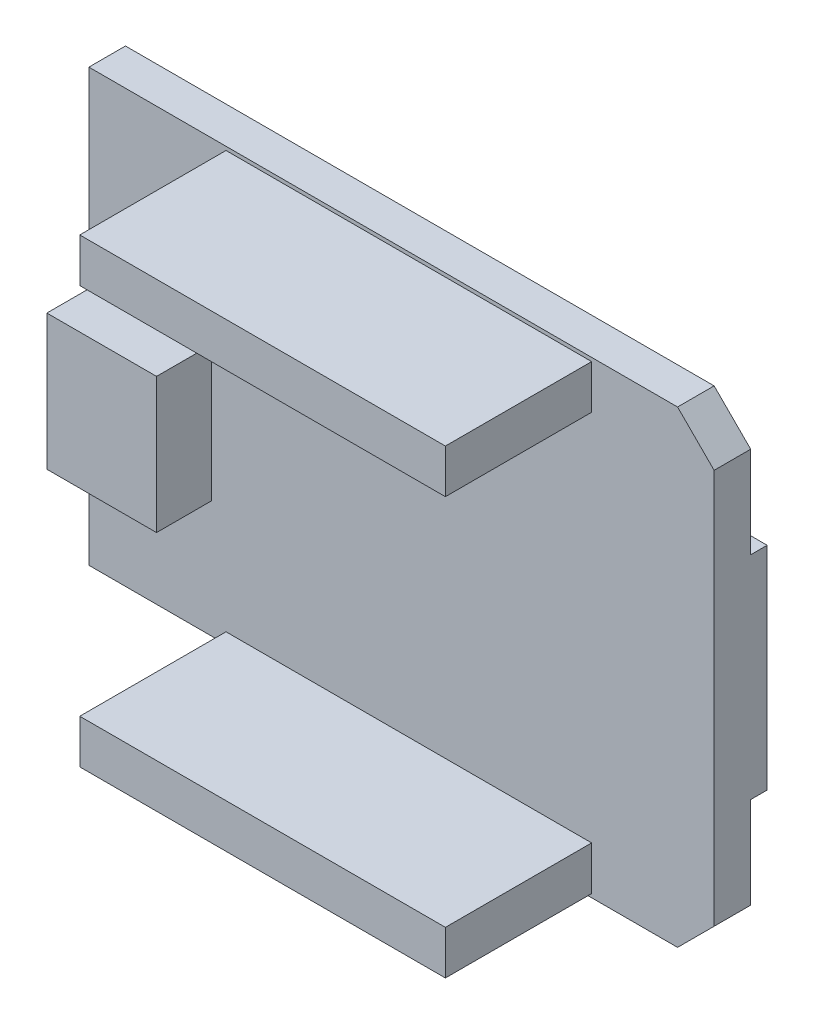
ISO-10303-21;
HEADER;
FILE_DESCRIPTION(('STEP AP214'),'2;1');
FILE_NAME('part.step','',(''),(''),'','','');
FILE_SCHEMA(('AUTOMOTIVE_DESIGN { 1 0 10303 214 1 1 1 1 }'));
ENDSEC;
DATA;
#1=APPLICATION_CONTEXT('core data for automotive mechanical design processes');
#2=APPLICATION_PROTOCOL_DEFINITION('international standard','automotive_design',2000,#1);
#3=PRODUCT_CONTEXT('',#1,'mechanical');
#4=PRODUCT('Part','Part','',(#3));
#5=PRODUCT_RELATED_PRODUCT_CATEGORY('part','',(#4));
#6=PRODUCT_DEFINITION_FORMATION('','',#4);
#7=PRODUCT_DEFINITION_CONTEXT('part definition',#1,'design');
#8=PRODUCT_DEFINITION('design','',#6,#7);
#9=PRODUCT_DEFINITION_SHAPE('','',#8);
#10=(LENGTH_UNIT() NAMED_UNIT(*) SI_UNIT(.MILLI.,.METRE.));
#11=(NAMED_UNIT(*) PLANE_ANGLE_UNIT() SI_UNIT($,.RADIAN.));
#12=(NAMED_UNIT(*) SI_UNIT($,.STERADIAN.) SOLID_ANGLE_UNIT());
#13=UNCERTAINTY_MEASURE_WITH_UNIT(LENGTH_MEASURE(1.E-05),#10,'distance_accuracy_value','');
#14=(GEOMETRIC_REPRESENTATION_CONTEXT(3) GLOBAL_UNCERTAINTY_ASSIGNED_CONTEXT((#13)) GLOBAL_UNIT_ASSIGNED_CONTEXT((#10,
#11,#12)) REPRESENTATION_CONTEXT('',''));
#15=CARTESIAN_POINT('',(0.,0.,0.));
#16=DIRECTION('',(0.,0.,1.));
#17=DIRECTION('',(1.,0.,0.));
#18=AXIS2_PLACEMENT_3D('',#15,#16,#17);
#19=CARTESIAN_POINT('',(0.,0.,0.));
#20=DIRECTION('',(0.,0.,1.));
#21=DIRECTION('',(1.,0.,0.));
#22=AXIS2_PLACEMENT_3D('',#19,#20,#21);
#23=PLANE('',#22);
#24=DIRECTION('',(0.,1.,0.));
#25=VECTOR('',#24,1.);
#26=CARTESIAN_POINT('',(19.1818637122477,8.10331560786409,0.));
#27=LINE('',#26,#25);
#28=CARTESIAN_POINT('',(19.1818637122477,3.10331560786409,0.));
#29=VERTEX_POINT('',#28);
#30=CARTESIAN_POINT('',(19.1818637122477,8.10331560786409,0.));
#31=VERTEX_POINT('',#30);
#32=EDGE_CURVE('E530',#29,#31,#27,.T.);
#33=ORIENTED_EDGE('',*,*,#32,.F.);
#34=DIRECTION('',(1.,0.,0.));
#35=VECTOR('',#34,1.);
#36=CARTESIAN_POINT('',(-2.81813628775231,3.10331560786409,0.));
#37=LINE('',#36,#35);
#38=CARTESIAN_POINT('',(-2.81813628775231,3.10331560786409,0.));
#39=VERTEX_POINT('',#38);
#40=EDGE_CURVE('E57',#39,#29,#37,.T.);
#41=ORIENTED_EDGE('',*,*,#40,.F.);
#42=DIRECTION('',(0.,1.,0.));
#43=VECTOR('',#42,1.);
#44=CARTESIAN_POINT('',(-2.81813628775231,-8.49668439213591,0.));
#45=LINE('',#44,#43);
#46=CARTESIAN_POINT('',(-2.81813628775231,-8.49668439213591,0.));
#47=VERTEX_POINT('',#46);
#48=EDGE_CURVE('E297',#47,#39,#45,.T.);
#49=ORIENTED_EDGE('',*,*,#48,.F.);
#50=DIRECTION('',(-1.,0.,0.));
#51=VECTOR('',#50,1.);
#52=CARTESIAN_POINT('',(-2.81813628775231,-8.49668439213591,0.));
#53=LINE('',#52,#51);
#54=CARTESIAN_POINT('',(12.1818637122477,-8.49668439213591,0.));
#55=VERTEX_POINT('',#54);
#56=EDGE_CURVE('E303',#55,#47,#53,.T.);
#57=ORIENTED_EDGE('',*,*,#56,.F.);
#58=DIRECTION('',(0.,-1.,0.));
#59=VECTOR('',#58,1.);
#60=CARTESIAN_POINT('',(12.1818637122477,-8.49668439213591,0.));
#61=LINE('',#60,#59);
#62=CARTESIAN_POINT('',(12.1818637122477,-8.49430701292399,0.));
#63=VERTEX_POINT('',#62);
#64=EDGE_CURVE('E317',#63,#55,#61,.T.);
#65=ORIENTED_EDGE('',*,*,#64,.F.);
#66=DIRECTION('',(-1.,0.,0.));
#67=VECTOR('',#66,1.);
#68=CARTESIAN_POINT('',(12.1818637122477,-8.49430701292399,0.));
#69=LINE('',#68,#67);
#70=CARTESIAN_POINT('',(19.1818637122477,-8.49430701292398,0.));
#71=VERTEX_POINT('',#70);
#72=EDGE_CURVE('E65',#71,#63,#69,.T.);
#73=ORIENTED_EDGE('',*,*,#72,.F.);
#74=CARTESIAN_POINT('',(19.1818637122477,-13.4966843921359,0.));
#75=VERTEX_POINT('',#74);
#76=EDGE_CURVE('E531',#75,#71,#27,.T.);
#77=ORIENTED_EDGE('',*,*,#76,.F.);
#78=DIRECTION('',(0.707106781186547,0.707106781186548,0.));
#79=VECTOR('',#78,1.);
#80=CARTESIAN_POINT('',(19.1818637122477,-13.4966843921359,0.));
#81=LINE('',#80,#79);
#82=CARTESIAN_POINT('',(17.1818637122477,-15.4966843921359,0.));
#83=VERTEX_POINT('',#82);
#84=EDGE_CURVE('E527',#83,#75,#81,.T.);
#85=ORIENTED_EDGE('',*,*,#84,.F.);
#86=DIRECTION('',(1.,0.,0.));
#87=VECTOR('',#86,1.);
#88=CARTESIAN_POINT('',(-7.61813628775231,-15.4966843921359,0.));
#89=LINE('',#88,#87);
#90=CARTESIAN_POINT('',(-7.61813628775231,-15.4966843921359,0.));
#91=VERTEX_POINT('',#90);
#92=EDGE_CURVE('E524',#91,#83,#89,.T.);
#93=ORIENTED_EDGE('',*,*,#92,.F.);
#94=DIRECTION('',(0.,-1.,0.));
#95=VECTOR('',#94,1.);
#96=CARTESIAN_POINT('',(-7.61813628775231,-13.4966843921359,0.));
#97=LINE('',#96,#95);
#98=CARTESIAN_POINT('',(-7.61813628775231,-13.4966843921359,0.));
#99=VERTEX_POINT('',#98);
#100=EDGE_CURVE('E521',#99,#91,#97,.T.);
#101=ORIENTED_EDGE('',*,*,#100,.F.);
#102=DIRECTION('',(1.,0.,0.));
#103=VECTOR('',#102,1.);
#104=CARTESIAN_POINT('',(-15.0181362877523,-13.4966843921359,0.));
#105=LINE('',#104,#103);
#106=CARTESIAN_POINT('',(-15.0181362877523,-13.4966843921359,0.));
#107=VERTEX_POINT('',#106);
#108=EDGE_CURVE('E518',#107,#99,#105,.T.);
#109=ORIENTED_EDGE('',*,*,#108,.F.);
#110=DIRECTION('',(0.,-1.,0.));
#111=VECTOR('',#110,1.);
#112=CARTESIAN_POINT('',(-15.0181362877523,-7.89668439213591,0.));
#113=LINE('',#112,#111);
#114=CARTESIAN_POINT('',(-15.0181362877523,-7.89668439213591,0.));
#115=VERTEX_POINT('',#114);
#116=EDGE_CURVE('E515',#115,#107,#113,.T.);
#117=ORIENTED_EDGE('',*,*,#116,.F.);
#118=DIRECTION('',(-1.,0.,0.));
#119=VECTOR('',#118,1.);
#120=CARTESIAN_POINT('',(-15.0181362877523,-7.89668439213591,0.));
#121=LINE('',#120,#119);
#122=CARTESIAN_POINT('',(-14.0181362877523,-7.89668439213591,0.));
#123=VERTEX_POINT('',#122);
#124=EDGE_CURVE('E512',#123,#115,#121,.T.);
#125=ORIENTED_EDGE('',*,*,#124,.F.);
#126=DIRECTION('',(0.,-1.,0.));
#127=VECTOR('',#126,1.);
#128=CARTESIAN_POINT('',(-14.0181362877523,1.10331560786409,0.));
#129=LINE('',#128,#127);
#130=CARTESIAN_POINT('',(-14.0181362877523,1.10331560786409,0.));
#131=VERTEX_POINT('',#130);
#132=EDGE_CURVE('E509',#131,#123,#129,.T.);
#133=ORIENTED_EDGE('',*,*,#132,.F.);
#134=DIRECTION('',(1.,0.,0.));
#135=VECTOR('',#134,1.);
#136=CARTESIAN_POINT('',(-15.0181362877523,1.10331560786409,0.));
#137=LINE('',#136,#135);
#138=CARTESIAN_POINT('',(-15.0181362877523,1.10331560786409,0.));
#139=VERTEX_POINT('',#138);
#140=EDGE_CURVE('E506',#139,#131,#137,.T.);
#141=ORIENTED_EDGE('',*,*,#140,.F.);
#142=DIRECTION('',(0.,-1.,0.));
#143=VECTOR('',#142,1.);
#144=CARTESIAN_POINT('',(-15.0181362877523,10.1033156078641,0.));
#145=LINE('',#144,#143);
#146=CARTESIAN_POINT('',(-15.0181362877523,10.1033156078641,0.));
#147=VERTEX_POINT('',#146);
#148=EDGE_CURVE('E460',#147,#139,#145,.T.);
#149=ORIENTED_EDGE('',*,*,#148,.F.);
#150=DIRECTION('',(-1.,0.,0.));
#151=VECTOR('',#150,1.);
#152=CARTESIAN_POINT('',(-15.0181362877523,10.1033156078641,0.));
#153=LINE('',#152,#151);
#154=CARTESIAN_POINT('',(17.1818637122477,10.1033156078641,0.));
#155=VERTEX_POINT('',#154);
#156=EDGE_CURVE('E466',#155,#147,#153,.T.);
#157=ORIENTED_EDGE('',*,*,#156,.F.);
#158=DIRECTION('',(-0.707106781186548,0.707106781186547,0.));
#159=VECTOR('',#158,1.);
#160=CARTESIAN_POINT('',(17.1818637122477,10.1033156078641,0.));
#161=LINE('',#160,#159);
#162=EDGE_CURVE('E534',#31,#155,#161,.T.);
#163=ORIENTED_EDGE('',*,*,#162,.F.);
#164=EDGE_LOOP('',(#33,#41,#49,#57,#65,#73,#77,#85,#93,#101,#109,#117,#125,#133,#141,#149,#157,#163));
#165=FACE_BOUND('',#164,.T.);
#166=ADVANCED_FACE('F41',(#165),#23,.F.);
#167=CARTESIAN_POINT('',(12.1818637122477,-8.49668439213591,-3.));
#168=DIRECTION('',(-1.,0.,0.));
#169=DIRECTION('',(0.,0.,1.));
#170=AXIS2_PLACEMENT_3D('',#167,#168,#169);
#171=PLANE('',#170);
#172=DIRECTION('',(0.,0.,1.));
#173=VECTOR('',#172,1.);
#174=CARTESIAN_POINT('',(12.1818637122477,-8.49430701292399,-0.9));
#175=LINE('',#174,#173);
#176=CARTESIAN_POINT('',(12.1818637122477,-8.49430701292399,-0.9));
#177=VERTEX_POINT('',#176);
#178=EDGE_CURVE('E287',#177,#63,#175,.T.);
#179=ORIENTED_EDGE('',*,*,#178,.T.);
#180=ORIENTED_EDGE('',*,*,#64,.T.);
#181=DIRECTION('',(0.,0.,1.));
#182=VECTOR('',#181,1.);
#183=CARTESIAN_POINT('',(12.1818637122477,-8.49668439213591,-3.));
#184=LINE('',#183,#182);
#185=CARTESIAN_POINT('',(12.1818637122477,-8.49668439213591,-3.));
#186=VERTEX_POINT('',#185);
#187=EDGE_CURVE('E264',#186,#55,#184,.T.);
#188=ORIENTED_EDGE('',*,*,#187,.F.);
#189=DIRECTION('',(0.,-1.,0.));
#190=VECTOR('',#189,1.);
#191=CARTESIAN_POINT('',(12.1818637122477,-8.49668439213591,-3.));
#192=LINE('',#191,#190);
#193=CARTESIAN_POINT('',(12.1818637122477,3.10331560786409,-3.));
#194=VERTEX_POINT('',#193);
#195=EDGE_CURVE('E261',#194,#186,#192,.T.);
#196=ORIENTED_EDGE('',*,*,#195,.F.);
#197=DIRECTION('',(0.,0.,1.));
#198=VECTOR('',#197,1.);
#199=CARTESIAN_POINT('',(12.1818637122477,3.10331560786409,-3.));
#200=LINE('',#199,#198);
#201=CARTESIAN_POINT('',(12.1818637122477,3.10331560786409,-0.9));
#202=VERTEX_POINT('',#201);
#203=EDGE_CURVE('E254',#194,#202,#200,.T.);
#204=ORIENTED_EDGE('',*,*,#203,.T.);
#205=DIRECTION('',(0.,1.,0.));
#206=VECTOR('',#205,1.);
#207=CARTESIAN_POINT('',(12.1818637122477,3.10331560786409,-0.9));
#208=LINE('',#207,#206);
#209=EDGE_CURVE('E258',#177,#202,#208,.T.);
#210=ORIENTED_EDGE('',*,*,#209,.F.);
#211=EDGE_LOOP('',(#179,#180,#188,#196,#204,#210));
#212=FACE_BOUND('',#211,.T.);
#213=ADVANCED_FACE('F256',(#212),#171,.F.);
#214=CARTESIAN_POINT('',(0.,0.,2.));
#215=DIRECTION('',(0.,0.,1.));
#216=DIRECTION('',(1.,0.,0.));
#217=AXIS2_PLACEMENT_3D('',#214,#215,#216);
#218=PLANE('',#217);
#219=DIRECTION('',(0.,-1.,0.));
#220=VECTOR('',#219,1.);
#221=CARTESIAN_POINT('',(-7.51813628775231,9.90331560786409,2.));
#222=LINE('',#221,#220);
#223=CARTESIAN_POINT('',(-7.51813628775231,9.90331560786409,2.));
#224=VERTEX_POINT('',#223);
#225=CARTESIAN_POINT('',(-7.51813628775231,7.50331560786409,2.));
#226=VERTEX_POINT('',#225);
#227=EDGE_CURVE('E438',#224,#226,#222,.T.);
#228=ORIENTED_EDGE('',*,*,#227,.F.);
#229=DIRECTION('',(-1.,0.,0.));
#230=VECTOR('',#229,1.);
#231=CARTESIAN_POINT('',(-7.51813628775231,9.90331560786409,2.));
#232=LINE('',#231,#230);
#233=CARTESIAN_POINT('',(12.4818637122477,9.90331560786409,2.));
#234=VERTEX_POINT('',#233);
#235=EDGE_CURVE('E419',#234,#224,#232,.T.);
#236=ORIENTED_EDGE('',*,*,#235,.F.);
#237=DIRECTION('',(0.,1.,0.));
#238=VECTOR('',#237,1.);
#239=CARTESIAN_POINT('',(12.4818637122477,9.90331560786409,2.));
#240=LINE('',#239,#238);
#241=CARTESIAN_POINT('',(12.4818637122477,7.50331560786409,2.));
#242=VERTEX_POINT('',#241);
#243=EDGE_CURVE('E425',#242,#234,#240,.T.);
#244=ORIENTED_EDGE('',*,*,#243,.F.);
#245=DIRECTION('',(1.,0.,0.));
#246=VECTOR('',#245,1.);
#247=CARTESIAN_POINT('',(-7.51813628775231,7.50331560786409,2.));
#248=LINE('',#247,#246);
#249=EDGE_CURVE('E441',#226,#242,#248,.T.);
#250=ORIENTED_EDGE('',*,*,#249,.F.);
#251=EDGE_LOOP('',(#228,#236,#244,#250));
#252=FACE_BOUND('',#251,.T.);
#253=DIRECTION('',(1.,0.,0.));
#254=VECTOR('',#253,1.);
#255=CARTESIAN_POINT('',(-7.51813628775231,-15.2966843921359,2.));
#256=LINE('',#255,#254);
#257=CARTESIAN_POINT('',(-7.51813628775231,-15.2966843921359,2.));
#258=VERTEX_POINT('',#257);
#259=CARTESIAN_POINT('',(12.4818637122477,-15.2966843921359,2.));
#260=VERTEX_POINT('',#259);
#261=EDGE_CURVE('E397',#258,#260,#256,.T.);
#262=ORIENTED_EDGE('',*,*,#261,.F.);
#263=DIRECTION('',(0.,-1.,0.));
#264=VECTOR('',#263,1.);
#265=CARTESIAN_POINT('',(-7.51813628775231,-15.2966843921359,2.));
#266=LINE('',#265,#264);
#267=CARTESIAN_POINT('',(-7.51813628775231,-12.8966843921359,2.));
#268=VERTEX_POINT('',#267);
#269=EDGE_CURVE('E378',#268,#258,#266,.T.);
#270=ORIENTED_EDGE('',*,*,#269,.F.);
#271=DIRECTION('',(-1.,0.,0.));
#272=VECTOR('',#271,1.);
#273=CARTESIAN_POINT('',(-7.51813628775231,-12.8966843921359,2.));
#274=LINE('',#273,#272);
#275=CARTESIAN_POINT('',(12.4818637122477,-12.8966843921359,2.));
#276=VERTEX_POINT('',#275);
#277=EDGE_CURVE('E384',#276,#268,#274,.T.);
#278=ORIENTED_EDGE('',*,*,#277,.F.);
#279=DIRECTION('',(0.,1.,0.));
#280=VECTOR('',#279,1.);
#281=CARTESIAN_POINT('',(12.4818637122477,-15.2966843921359,2.));
#282=LINE('',#281,#280);
#283=EDGE_CURVE('E400',#260,#276,#282,.T.);
#284=ORIENTED_EDGE('',*,*,#283,.F.);
#285=EDGE_LOOP('',(#262,#270,#278,#284));
#286=FACE_BOUND('',#285,.T.);
#287=DIRECTION('',(0.,1.,0.));
#288=VECTOR('',#287,1.);
#289=CARTESIAN_POINT('',(-8.31813628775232,0.303315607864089,2.));
#290=LINE('',#289,#288);
#291=CARTESIAN_POINT('',(-8.31813628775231,-7.09668439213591,2.));
#292=VERTEX_POINT('',#291);
#293=CARTESIAN_POINT('',(-8.31813628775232,0.303315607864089,2.));
#294=VERTEX_POINT('',#293);
#295=EDGE_CURVE('E355',#292,#294,#290,.T.);
#296=ORIENTED_EDGE('',*,*,#295,.F.);
#297=DIRECTION('',(1.,0.,0.));
#298=VECTOR('',#297,1.);
#299=CARTESIAN_POINT('',(-14.3181362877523,-7.09668439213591,2.));
#300=LINE('',#299,#298);
#301=CARTESIAN_POINT('',(-14.0181362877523,-7.09668439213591,2.));
#302=VERTEX_POINT('',#301);
#303=EDGE_CURVE('E350',#302,#292,#300,.T.);
#304=ORIENTED_EDGE('',*,*,#303,.F.);
#305=DIRECTION('',(0.,-1.,0.));
#306=VECTOR('',#305,1.);
#307=CARTESIAN_POINT('',(-14.0181362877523,1.10331560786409,2.));
#308=LINE('',#307,#306);
#309=CARTESIAN_POINT('',(-14.0181362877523,-7.89668439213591,2.));
#310=VERTEX_POINT('',#309);
#311=EDGE_CURVE('E469',#302,#310,#308,.T.);
#312=ORIENTED_EDGE('',*,*,#311,.T.);
#313=DIRECTION('',(-1.,0.,0.));
#314=VECTOR('',#313,1.);
#315=CARTESIAN_POINT('',(-15.0181362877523,-7.89668439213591,2.));
#316=LINE('',#315,#314);
#317=CARTESIAN_POINT('',(-15.0181362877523,-7.89668439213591,2.));
#318=VERTEX_POINT('',#317);
#319=EDGE_CURVE('E474',#310,#318,#316,.T.);
#320=ORIENTED_EDGE('',*,*,#319,.T.);
#321=DIRECTION('',(0.,-1.,0.));
#322=VECTOR('',#321,1.);
#323=CARTESIAN_POINT('',(-15.0181362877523,-7.89668439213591,2.));
#324=LINE('',#323,#322);
#325=CARTESIAN_POINT('',(-15.0181362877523,-13.4966843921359,2.));
#326=VERTEX_POINT('',#325);
#327=EDGE_CURVE('E478',#318,#326,#324,.T.);
#328=ORIENTED_EDGE('',*,*,#327,.T.);
#329=DIRECTION('',(1.,0.,0.));
#330=VECTOR('',#329,1.);
#331=CARTESIAN_POINT('',(-15.0181362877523,-13.4966843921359,2.));
#332=LINE('',#331,#330);
#333=CARTESIAN_POINT('',(-7.61813628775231,-13.4966843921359,2.));
#334=VERTEX_POINT('',#333);
#335=EDGE_CURVE('E481',#326,#334,#332,.T.);
#336=ORIENTED_EDGE('',*,*,#335,.T.);
#337=DIRECTION('',(0.,-1.,0.));
#338=VECTOR('',#337,1.);
#339=CARTESIAN_POINT('',(-7.61813628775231,-13.4966843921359,2.));
#340=LINE('',#339,#338);
#341=CARTESIAN_POINT('',(-7.61813628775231,-15.4966843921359,2.));
#342=VERTEX_POINT('',#341);
#343=EDGE_CURVE('E484',#334,#342,#340,.T.);
#344=ORIENTED_EDGE('',*,*,#343,.T.);
#345=DIRECTION('',(1.,0.,0.));
#346=VECTOR('',#345,1.);
#347=CARTESIAN_POINT('',(-7.61813628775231,-15.4966843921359,2.));
#348=LINE('',#347,#346);
#349=CARTESIAN_POINT('',(17.1818637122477,-15.4966843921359,2.));
#350=VERTEX_POINT('',#349);
#351=EDGE_CURVE('E487',#342,#350,#348,.T.);
#352=ORIENTED_EDGE('',*,*,#351,.T.);
#353=DIRECTION('',(0.707106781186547,0.707106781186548,0.));
#354=VECTOR('',#353,1.);
#355=CARTESIAN_POINT('',(19.1818637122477,-13.4966843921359,2.));
#356=LINE('',#355,#354);
#357=CARTESIAN_POINT('',(19.1818637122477,-13.4966843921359,2.));
#358=VERTEX_POINT('',#357);
#359=EDGE_CURVE('E490',#350,#358,#356,.T.);
#360=ORIENTED_EDGE('',*,*,#359,.T.);
#361=DIRECTION('',(0.,1.,0.));
#362=VECTOR('',#361,1.);
#363=CARTESIAN_POINT('',(19.1818637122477,8.10331560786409,2.));
#364=LINE('',#363,#362);
#365=CARTESIAN_POINT('',(19.1818637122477,8.10331560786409,2.));
#366=VERTEX_POINT('',#365);
#367=EDGE_CURVE('E493',#358,#366,#364,.T.);
#368=ORIENTED_EDGE('',*,*,#367,.T.);
#369=DIRECTION('',(-0.707106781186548,0.707106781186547,0.));
#370=VECTOR('',#369,1.);
#371=CARTESIAN_POINT('',(17.1818637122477,10.1033156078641,2.));
#372=LINE('',#371,#370);
#373=CARTESIAN_POINT('',(17.1818637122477,10.1033156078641,2.));
#374=VERTEX_POINT('',#373);
#375=EDGE_CURVE('E496',#366,#374,#372,.T.);
#376=ORIENTED_EDGE('',*,*,#375,.T.);
#377=DIRECTION('',(-1.,0.,0.));
#378=VECTOR('',#377,1.);
#379=CARTESIAN_POINT('',(-15.0181362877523,10.1033156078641,2.));
#380=LINE('',#379,#378);
#381=CARTESIAN_POINT('',(-15.0181362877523,10.1033156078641,2.));
#382=VERTEX_POINT('',#381);
#383=EDGE_CURVE('E499',#374,#382,#380,.T.);
#384=ORIENTED_EDGE('',*,*,#383,.T.);
#385=DIRECTION('',(0.,-1.,0.));
#386=VECTOR('',#385,1.);
#387=CARTESIAN_POINT('',(-15.0181362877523,10.1033156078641,2.));
#388=LINE('',#387,#386);
#389=CARTESIAN_POINT('',(-15.0181362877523,1.10331560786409,2.));
#390=VERTEX_POINT('',#389);
#391=EDGE_CURVE('E461',#382,#390,#388,.T.);
#392=ORIENTED_EDGE('',*,*,#391,.T.);
#393=DIRECTION('',(1.,0.,0.));
#394=VECTOR('',#393,1.);
#395=CARTESIAN_POINT('',(-15.0181362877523,1.10331560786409,2.));
#396=LINE('',#395,#394);
#397=CARTESIAN_POINT('',(-14.0181362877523,1.10331560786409,2.));
#398=VERTEX_POINT('',#397);
#399=EDGE_CURVE('E465',#390,#398,#396,.T.);
#400=ORIENTED_EDGE('',*,*,#399,.T.);
#401=CARTESIAN_POINT('',(-14.0181362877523,0.303315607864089,2.));
#402=VERTEX_POINT('',#401);
#403=EDGE_CURVE('E470',#398,#402,#308,.T.);
#404=ORIENTED_EDGE('',*,*,#403,.T.);
#405=DIRECTION('',(-1.,0.,0.));
#406=VECTOR('',#405,1.);
#407=CARTESIAN_POINT('',(-14.3181362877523,0.303315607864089,2.));
#408=LINE('',#407,#406);
#409=EDGE_CURVE('E337',#294,#402,#408,.T.);
#410=ORIENTED_EDGE('',*,*,#409,.F.);
#411=EDGE_LOOP('',(#296,#304,#312,#320,#328,#336,#344,#352,#360,#368,#376,#384,#392,#400,#404,#410));
#412=FACE_BOUND('',#411,.T.);
#413=ADVANCED_FACE('F600',(#252,#286,#412),#218,.T.);
#414=CARTESIAN_POINT('',(-15.0181362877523,10.1033156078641,2.));
#415=DIRECTION('',(1.,0.,0.));
#416=DIRECTION('',(0.,1.,0.));
#417=AXIS2_PLACEMENT_3D('',#414,#415,#416);
#418=PLANE('',#417);
#419=ORIENTED_EDGE('',*,*,#148,.T.);
#420=DIRECTION('',(0.,0.,-1.));
#421=VECTOR('',#420,1.);
#422=CARTESIAN_POINT('',(-15.0181362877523,1.10331560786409,2.));
#423=LINE('',#422,#421);
#424=EDGE_CURVE('E11',#390,#139,#423,.T.);
#425=ORIENTED_EDGE('',*,*,#424,.F.);
#426=ORIENTED_EDGE('',*,*,#391,.F.);
#427=DIRECTION('',(0.,0.,-1.));
#428=VECTOR('',#427,1.);
#429=CARTESIAN_POINT('',(-15.0181362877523,10.1033156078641,2.));
#430=LINE('',#429,#428);
#431=EDGE_CURVE('E502',#382,#147,#430,.T.);
#432=ORIENTED_EDGE('',*,*,#431,.T.);
#433=EDGE_LOOP('',(#419,#425,#426,#432));
#434=FACE_BOUND('',#433,.T.);
#435=ADVANCED_FACE('F43',(#434),#418,.F.);
#436=CARTESIAN_POINT('',(-15.0181362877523,1.10331560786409,2.));
#437=DIRECTION('',(0.,1.,0.));
#438=DIRECTION('',(0.,0.,1.));
#439=AXIS2_PLACEMENT_3D('',#436,#437,#438);
#440=PLANE('',#439);
#441=ORIENTED_EDGE('',*,*,#140,.T.);
#442=DIRECTION('',(0.,0.,-1.));
#443=VECTOR('',#442,1.);
#444=CARTESIAN_POINT('',(-14.0181362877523,1.10331560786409,2.));
#445=LINE('',#444,#443);
#446=EDGE_CURVE('E50',#398,#131,#445,.T.);
#447=ORIENTED_EDGE('',*,*,#446,.F.);
#448=ORIENTED_EDGE('',*,*,#399,.F.);
#449=ORIENTED_EDGE('',*,*,#424,.T.);
#450=EDGE_LOOP('',(#441,#447,#448,#449));
#451=FACE_BOUND('',#450,.T.);
#452=ADVANCED_FACE('F979',(#451),#440,.F.);
#453=CARTESIAN_POINT('',(-14.0181362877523,1.10331560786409,2.));
#454=DIRECTION('',(1.,0.,0.));
#455=DIRECTION('',(0.,1.,0.));
#456=AXIS2_PLACEMENT_3D('',#453,#454,#455);
#457=PLANE('',#456);
#458=ORIENTED_EDGE('',*,*,#132,.T.);
#459=DIRECTION('',(0.,0.,-1.));
#460=VECTOR('',#459,1.);
#461=CARTESIAN_POINT('',(-14.0181362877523,-7.89668439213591,2.));
#462=LINE('',#461,#460);
#463=EDGE_CURVE('E574',#310,#123,#462,.T.);
#464=ORIENTED_EDGE('',*,*,#463,.F.);
#465=ORIENTED_EDGE('',*,*,#311,.F.);
#466=EDGE_CURVE('E475',#402,#302,#308,.T.);
#467=ORIENTED_EDGE('',*,*,#466,.F.);
#468=ORIENTED_EDGE('',*,*,#403,.F.);
#469=ORIENTED_EDGE('',*,*,#446,.T.);
#470=EDGE_LOOP('',(#458,#464,#465,#467,#468,#469));
#471=FACE_BOUND('',#470,.T.);
#472=ADVANCED_FACE('F583',(#471),#457,.F.);
#473=CARTESIAN_POINT('',(-15.0181362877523,-7.89668439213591,2.));
#474=DIRECTION('',(0.,-1.,0.));
#475=DIRECTION('',(0.,0.,-1.));
#476=AXIS2_PLACEMENT_3D('',#473,#474,#475);
#477=PLANE('',#476);
#478=ORIENTED_EDGE('',*,*,#124,.T.);
#479=DIRECTION('',(0.,0.,-1.));
#480=VECTOR('',#479,1.);
#481=CARTESIAN_POINT('',(-15.0181362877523,-7.89668439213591,2.));
#482=LINE('',#481,#480);
#483=EDGE_CURVE('E570',#318,#115,#482,.T.);
#484=ORIENTED_EDGE('',*,*,#483,.F.);
#485=ORIENTED_EDGE('',*,*,#319,.F.);
#486=ORIENTED_EDGE('',*,*,#463,.T.);
#487=EDGE_LOOP('',(#478,#484,#485,#486));
#488=FACE_BOUND('',#487,.T.);
#489=ADVANCED_FACE('F592',(#488),#477,.F.);
#490=CARTESIAN_POINT('',(-15.0181362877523,-7.89668439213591,2.));
#491=DIRECTION('',(1.,0.,0.));
#492=DIRECTION('',(0.,0.,-1.));
#493=AXIS2_PLACEMENT_3D('',#490,#491,#492);
#494=PLANE('',#493);
#495=ORIENTED_EDGE('',*,*,#116,.T.);
#496=DIRECTION('',(0.,0.,-1.));
#497=VECTOR('',#496,1.);
#498=CARTESIAN_POINT('',(-15.0181362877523,-13.4966843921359,2.));
#499=LINE('',#498,#497);
#500=EDGE_CURVE('E566',#326,#107,#499,.T.);
#501=ORIENTED_EDGE('',*,*,#500,.F.);
#502=ORIENTED_EDGE('',*,*,#327,.F.);
#503=ORIENTED_EDGE('',*,*,#483,.T.);
#504=EDGE_LOOP('',(#495,#501,#502,#503));
#505=FACE_BOUND('',#504,.T.);
#506=ADVANCED_FACE('F596',(#505),#494,.F.);
#507=CARTESIAN_POINT('',(-15.0181362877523,-13.4966843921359,2.));
#508=DIRECTION('',(0.,1.,0.));
#509=DIRECTION('',(0.,0.,1.));
#510=AXIS2_PLACEMENT_3D('',#507,#508,#509);
#511=PLANE('',#510);
#512=ORIENTED_EDGE('',*,*,#108,.T.);
#513=DIRECTION('',(0.,0.,-1.));
#514=VECTOR('',#513,1.);
#515=CARTESIAN_POINT('',(-7.61813628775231,-13.4966843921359,2.));
#516=LINE('',#515,#514);
#517=EDGE_CURVE('E562',#334,#99,#516,.T.);
#518=ORIENTED_EDGE('',*,*,#517,.F.);
#519=ORIENTED_EDGE('',*,*,#335,.F.);
#520=ORIENTED_EDGE('',*,*,#500,.T.);
#521=EDGE_LOOP('',(#512,#518,#519,#520));
#522=FACE_BOUND('',#521,.T.);
#523=ADVANCED_FACE('F659',(#522),#511,.F.);
#524=CARTESIAN_POINT('',(-7.61813628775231,-13.4966843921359,2.));
#525=DIRECTION('',(1.,0.,0.));
#526=DIRECTION('',(0.,0.,-1.));
#527=AXIS2_PLACEMENT_3D('',#524,#525,#526);
#528=PLANE('',#527);
#529=ORIENTED_EDGE('',*,*,#100,.T.);
#530=DIRECTION('',(0.,0.,-1.));
#531=VECTOR('',#530,1.);
#532=CARTESIAN_POINT('',(-7.61813628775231,-15.4966843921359,2.));
#533=LINE('',#532,#531);
#534=EDGE_CURVE('E558',#342,#91,#533,.T.);
#535=ORIENTED_EDGE('',*,*,#534,.F.);
#536=ORIENTED_EDGE('',*,*,#343,.F.);
#537=ORIENTED_EDGE('',*,*,#517,.T.);
#538=EDGE_LOOP('',(#529,#535,#536,#537));
#539=FACE_BOUND('',#538,.T.);
#540=ADVANCED_FACE('F657',(#539),#528,.F.);
#541=CARTESIAN_POINT('',(-7.61813628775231,-15.4966843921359,2.));
#542=DIRECTION('',(0.,1.,0.));
#543=DIRECTION('',(0.,0.,1.));
#544=AXIS2_PLACEMENT_3D('',#541,#542,#543);
#545=PLANE('',#544);
#546=ORIENTED_EDGE('',*,*,#92,.T.);
#547=DIRECTION('',(0.,0.,-1.));
#548=VECTOR('',#547,1.);
#549=CARTESIAN_POINT('',(17.1818637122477,-15.4966843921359,2.));
#550=LINE('',#549,#548);
#551=EDGE_CURVE('E554',#350,#83,#550,.T.);
#552=ORIENTED_EDGE('',*,*,#551,.F.);
#553=ORIENTED_EDGE('',*,*,#351,.F.);
#554=ORIENTED_EDGE('',*,*,#534,.T.);
#555=EDGE_LOOP('',(#546,#552,#553,#554));
#556=FACE_BOUND('',#555,.T.);
#557=ADVANCED_FACE('F653',(#556),#545,.F.);
#558=CARTESIAN_POINT('',(19.1818637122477,-13.4966843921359,2.));
#559=DIRECTION('',(-0.707106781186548,0.707106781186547,0.));
#560=DIRECTION('',(-0.707106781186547,-0.707106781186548,0.));
#561=AXIS2_PLACEMENT_3D('',#558,#559,#560);
#562=PLANE('',#561);
#563=ORIENTED_EDGE('',*,*,#84,.T.);
#564=DIRECTION('',(0.,0.,-1.));
#565=VECTOR('',#564,1.);
#566=CARTESIAN_POINT('',(19.1818637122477,-13.4966843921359,2.));
#567=LINE('',#566,#565);
#568=EDGE_CURVE('E550',#358,#75,#567,.T.);
#569=ORIENTED_EDGE('',*,*,#568,.F.);
#570=ORIENTED_EDGE('',*,*,#359,.F.);
#571=ORIENTED_EDGE('',*,*,#551,.T.);
#572=EDGE_LOOP('',(#563,#569,#570,#571));
#573=FACE_BOUND('',#572,.T.);
#574=ADVANCED_FACE('F649',(#573),#562,.F.);
#575=CARTESIAN_POINT('',(19.1818637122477,8.10331560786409,2.));
#576=DIRECTION('',(-1.,0.,0.));
#577=DIRECTION('',(0.,-1.,0.));
#578=AXIS2_PLACEMENT_3D('',#575,#576,#577);
#579=PLANE('',#578);
#580=ORIENTED_EDGE('',*,*,#76,.T.);
#581=DIRECTION('',(0.,0.,1.));
#582=VECTOR('',#581,1.);
#583=CARTESIAN_POINT('',(19.1818637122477,-8.49430701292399,-0.9));
#584=LINE('',#583,#582);
#585=CARTESIAN_POINT('',(19.1818637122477,-8.49430701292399,-0.9));
#586=VERTEX_POINT('',#585);
#587=EDGE_CURVE('E291',#586,#71,#584,.T.);
#588=ORIENTED_EDGE('',*,*,#587,.F.);
#589=DIRECTION('',(0.,-1.,0.));
#590=VECTOR('',#589,1.);
#591=CARTESIAN_POINT('',(19.1818637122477,3.10331560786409,-0.9));
#592=LINE('',#591,#590);
#593=CARTESIAN_POINT('',(19.1818637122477,3.10331560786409,-0.9));
#594=VERTEX_POINT('',#593);
#595=EDGE_CURVE('E273',#594,#586,#592,.T.);
#596=ORIENTED_EDGE('',*,*,#595,.F.);
#597=DIRECTION('',(0.,0.,1.));
#598=VECTOR('',#597,1.);
#599=CARTESIAN_POINT('',(19.1818637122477,3.10331560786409,-0.9));
#600=LINE('',#599,#598);
#601=EDGE_CURVE('E269',#594,#29,#600,.T.);
#602=ORIENTED_EDGE('',*,*,#601,.T.);
#603=ORIENTED_EDGE('',*,*,#32,.T.);
#604=DIRECTION('',(0.,0.,-1.));
#605=VECTOR('',#604,1.);
#606=CARTESIAN_POINT('',(19.1818637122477,8.10331560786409,2.));
#607=LINE('',#606,#605);
#608=EDGE_CURVE('E546',#366,#31,#607,.T.);
#609=ORIENTED_EDGE('',*,*,#608,.F.);
#610=ORIENTED_EDGE('',*,*,#367,.F.);
#611=ORIENTED_EDGE('',*,*,#568,.T.);
#612=EDGE_LOOP('',(#580,#588,#596,#602,#603,#609,#610,#611));
#613=FACE_BOUND('',#612,.T.);
#614=ADVANCED_FACE('F627',(#613),#579,.F.);
#615=CARTESIAN_POINT('',(17.1818637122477,10.1033156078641,2.));
#616=DIRECTION('',(-0.707106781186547,-0.707106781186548,0.));
#617=DIRECTION('',(0.707106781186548,-0.707106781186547,0.));
#618=AXIS2_PLACEMENT_3D('',#615,#616,#617);
#619=PLANE('',#618);
#620=ORIENTED_EDGE('',*,*,#162,.T.);
#621=DIRECTION('',(0.,0.,-1.));
#622=VECTOR('',#621,1.);
#623=CARTESIAN_POINT('',(17.1818637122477,10.1033156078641,2.));
#624=LINE('',#623,#622);
#625=EDGE_CURVE('E542',#374,#155,#624,.T.);
#626=ORIENTED_EDGE('',*,*,#625,.F.);
#627=ORIENTED_EDGE('',*,*,#375,.F.);
#628=ORIENTED_EDGE('',*,*,#608,.T.);
#629=EDGE_LOOP('',(#620,#626,#627,#628));
#630=FACE_BOUND('',#629,.T.);
#631=ADVANCED_FACE('F632',(#630),#619,.F.);
#632=CARTESIAN_POINT('',(-15.0181362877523,10.1033156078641,2.));
#633=DIRECTION('',(0.,-1.,0.));
#634=DIRECTION('',(0.,0.,-1.));
#635=AXIS2_PLACEMENT_3D('',#632,#633,#634);
#636=PLANE('',#635);
#637=ORIENTED_EDGE('',*,*,#156,.T.);
#638=ORIENTED_EDGE('',*,*,#431,.F.);
#639=ORIENTED_EDGE('',*,*,#383,.F.);
#640=ORIENTED_EDGE('',*,*,#625,.T.);
#641=EDGE_LOOP('',(#637,#638,#639,#640));
#642=FACE_BOUND('',#641,.T.);
#643=ADVANCED_FACE('F637',(#642),#636,.F.);
#644=CARTESIAN_POINT('',(-7.51813628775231,9.90331560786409,10.));
#645=DIRECTION('',(0.,-1.,0.));
#646=DIRECTION('',(0.,0.,-1.));
#647=AXIS2_PLACEMENT_3D('',#644,#645,#646);
#648=PLANE('',#647);
#649=ORIENTED_EDGE('',*,*,#235,.T.);
#650=DIRECTION('',(0.,0.,-1.));
#651=VECTOR('',#650,1.);
#652=CARTESIAN_POINT('',(-7.51813628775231,9.90331560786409,10.));
#653=LINE('',#652,#651);
#654=CARTESIAN_POINT('',(-7.51813628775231,9.90331560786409,10.));
#655=VERTEX_POINT('',#654);
#656=EDGE_CURVE('E457',#655,#224,#653,.T.);
#657=ORIENTED_EDGE('',*,*,#656,.F.);
#658=DIRECTION('',(-1.,0.,0.));
#659=VECTOR('',#658,1.);
#660=CARTESIAN_POINT('',(-7.51813628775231,9.90331560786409,10.));
#661=LINE('',#660,#659);
#662=CARTESIAN_POINT('',(12.4818637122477,9.90331560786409,10.));
#663=VERTEX_POINT('',#662);
#664=EDGE_CURVE('E420',#663,#655,#661,.T.);
#665=ORIENTED_EDGE('',*,*,#664,.F.);
#666=DIRECTION('',(0.,0.,-1.));
#667=VECTOR('',#666,1.);
#668=CARTESIAN_POINT('',(12.4818637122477,9.90331560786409,10.));
#669=LINE('',#668,#667);
#670=EDGE_CURVE('E434',#663,#234,#669,.T.);
#671=ORIENTED_EDGE('',*,*,#670,.T.);
#672=EDGE_LOOP('',(#649,#657,#665,#671));
#673=FACE_BOUND('',#672,.T.);
#674=ADVANCED_FACE('F680',(#673),#648,.F.);
#675=CARTESIAN_POINT('',(-7.51813628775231,9.90331560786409,10.));
#676=DIRECTION('',(1.,0.,0.));
#677=DIRECTION('',(0.,1.,0.));
#678=AXIS2_PLACEMENT_3D('',#675,#676,#677);
#679=PLANE('',#678);
#680=ORIENTED_EDGE('',*,*,#227,.T.);
#681=DIRECTION('',(0.,0.,-1.));
#682=VECTOR('',#681,1.);
#683=CARTESIAN_POINT('',(-7.51813628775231,7.50331560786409,10.));
#684=LINE('',#683,#682);
#685=CARTESIAN_POINT('',(-7.51813628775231,7.50331560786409,10.));
#686=VERTEX_POINT('',#685);
#687=EDGE_CURVE('E453',#686,#226,#684,.T.);
#688=ORIENTED_EDGE('',*,*,#687,.F.);
#689=DIRECTION('',(0.,-1.,0.));
#690=VECTOR('',#689,1.);
#691=CARTESIAN_POINT('',(-7.51813628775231,9.90331560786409,10.));
#692=LINE('',#691,#690);
#693=EDGE_CURVE('E424',#655,#686,#692,.T.);
#694=ORIENTED_EDGE('',*,*,#693,.F.);
#695=ORIENTED_EDGE('',*,*,#656,.T.);
#696=EDGE_LOOP('',(#680,#688,#694,#695));
#697=FACE_BOUND('',#696,.T.);
#698=ADVANCED_FACE('F710',(#697),#679,.F.);
#699=CARTESIAN_POINT('',(-7.51813628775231,7.50331560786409,10.));
#700=DIRECTION('',(0.,1.,0.));
#701=DIRECTION('',(-1.,0.,0.));
#702=AXIS2_PLACEMENT_3D('',#699,#700,#701);
#703=PLANE('',#702);
#704=ORIENTED_EDGE('',*,*,#249,.T.);
#705=DIRECTION('',(0.,0.,-1.));
#706=VECTOR('',#705,1.);
#707=CARTESIAN_POINT('',(12.4818637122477,7.50331560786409,10.));
#708=LINE('',#707,#706);
#709=CARTESIAN_POINT('',(12.4818637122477,7.50331560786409,10.));
#710=VERTEX_POINT('',#709);
#711=EDGE_CURVE('E450',#710,#242,#708,.T.);
#712=ORIENTED_EDGE('',*,*,#711,.F.);
#713=DIRECTION('',(1.,0.,0.));
#714=VECTOR('',#713,1.);
#715=CARTESIAN_POINT('',(-7.51813628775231,7.50331560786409,10.));
#716=LINE('',#715,#714);
#717=EDGE_CURVE('E428',#686,#710,#716,.T.);
#718=ORIENTED_EDGE('',*,*,#717,.F.);
#719=ORIENTED_EDGE('',*,*,#687,.T.);
#720=EDGE_LOOP('',(#704,#712,#718,#719));
#721=FACE_BOUND('',#720,.T.);
#722=ADVANCED_FACE('F719',(#721),#703,.F.);
#723=CARTESIAN_POINT('',(12.4818637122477,9.90331560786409,10.));
#724=DIRECTION('',(-1.,0.,0.));
#725=DIRECTION('',(0.,-1.,0.));
#726=AXIS2_PLACEMENT_3D('',#723,#724,#725);
#727=PLANE('',#726);
#728=ORIENTED_EDGE('',*,*,#243,.T.);
#729=ORIENTED_EDGE('',*,*,#670,.F.);
#730=DIRECTION('',(0.,1.,0.));
#731=VECTOR('',#730,1.);
#732=CARTESIAN_POINT('',(12.4818637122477,9.90331560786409,10.));
#733=LINE('',#732,#731);
#734=EDGE_CURVE('E431',#710,#663,#733,.T.);
#735=ORIENTED_EDGE('',*,*,#734,.F.);
#736=ORIENTED_EDGE('',*,*,#711,.T.);
#737=EDGE_LOOP('',(#728,#729,#735,#736));
#738=FACE_BOUND('',#737,.T.);
#739=ADVANCED_FACE('F729',(#738),#727,.F.);
#740=CARTESIAN_POINT('',(0.,0.,10.));
#741=DIRECTION('',(0.,0.,-1.));
#742=DIRECTION('',(-1.,0.,0.));
#743=AXIS2_PLACEMENT_3D('',#740,#741,#742);
#744=PLANE('',#743);
#745=ORIENTED_EDGE('',*,*,#664,.T.);
#746=ORIENTED_EDGE('',*,*,#693,.T.);
#747=ORIENTED_EDGE('',*,*,#717,.T.);
#748=ORIENTED_EDGE('',*,*,#734,.T.);
#749=EDGE_LOOP('',(#745,#746,#747,#748));
#750=FACE_BOUND('',#749,.T.);
#751=ADVANCED_FACE('F738',(#750),#744,.F.);
#752=CARTESIAN_POINT('',(-7.51813628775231,-15.2966843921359,10.));
#753=DIRECTION('',(1.,0.,0.));
#754=DIRECTION('',(0.,0.,-1.));
#755=AXIS2_PLACEMENT_3D('',#752,#753,#754);
#756=PLANE('',#755);
#757=ORIENTED_EDGE('',*,*,#269,.T.);
#758=DIRECTION('',(0.,0.,-1.));
#759=VECTOR('',#758,1.);
#760=CARTESIAN_POINT('',(-7.51813628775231,-15.2966843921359,10.));
#761=LINE('',#760,#759);
#762=CARTESIAN_POINT('',(-7.51813628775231,-15.2966843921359,10.));
#763=VERTEX_POINT('',#762);
#764=EDGE_CURVE('E416',#763,#258,#761,.T.);
#765=ORIENTED_EDGE('',*,*,#764,.F.);
#766=DIRECTION('',(0.,-1.,0.));
#767=VECTOR('',#766,1.);
#768=CARTESIAN_POINT('',(-7.51813628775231,-15.2966843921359,10.));
#769=LINE('',#768,#767);
#770=CARTESIAN_POINT('',(-7.51813628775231,-12.8966843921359,10.));
#771=VERTEX_POINT('',#770);
#772=EDGE_CURVE('E379',#771,#763,#769,.T.);
#773=ORIENTED_EDGE('',*,*,#772,.F.);
#774=DIRECTION('',(0.,0.,-1.));
#775=VECTOR('',#774,1.);
#776=CARTESIAN_POINT('',(-7.51813628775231,-12.8966843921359,10.));
#777=LINE('',#776,#775);
#778=EDGE_CURVE('E393',#771,#268,#777,.T.);
#779=ORIENTED_EDGE('',*,*,#778,.T.);
#780=EDGE_LOOP('',(#757,#765,#773,#779));
#781=FACE_BOUND('',#780,.T.);
#782=ADVANCED_FACE('F746',(#781),#756,.F.);
#783=CARTESIAN_POINT('',(-7.51813628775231,-15.2966843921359,10.));
#784=DIRECTION('',(0.,1.,0.));
#785=DIRECTION('',(-1.,0.,0.));
#786=AXIS2_PLACEMENT_3D('',#783,#784,#785);
#787=PLANE('',#786);
#788=ORIENTED_EDGE('',*,*,#261,.T.);
#789=DIRECTION('',(0.,0.,-1.));
#790=VECTOR('',#789,1.);
#791=CARTESIAN_POINT('',(12.4818637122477,-15.2966843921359,10.));
#792=LINE('',#791,#790);
#793=CARTESIAN_POINT('',(12.4818637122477,-15.2966843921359,10.));
#794=VERTEX_POINT('',#793);
#795=EDGE_CURVE('E412',#794,#260,#792,.T.);
#796=ORIENTED_EDGE('',*,*,#795,.F.);
#797=DIRECTION('',(1.,0.,0.));
#798=VECTOR('',#797,1.);
#799=CARTESIAN_POINT('',(-7.51813628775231,-15.2966843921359,10.));
#800=LINE('',#799,#798);
#801=EDGE_CURVE('E383',#763,#794,#800,.T.);
#802=ORIENTED_EDGE('',*,*,#801,.F.);
#803=ORIENTED_EDGE('',*,*,#764,.T.);
#804=EDGE_LOOP('',(#788,#796,#802,#803));
#805=FACE_BOUND('',#804,.T.);
#806=ADVANCED_FACE('F754',(#805),#787,.F.);
#807=CARTESIAN_POINT('',(12.4818637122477,-15.2966843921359,10.));
#808=DIRECTION('',(-1.,0.,0.));
#809=DIRECTION('',(0.,0.,1.));
#810=AXIS2_PLACEMENT_3D('',#807,#808,#809);
#811=PLANE('',#810);
#812=ORIENTED_EDGE('',*,*,#283,.T.);
#813=DIRECTION('',(0.,0.,-1.));
#814=VECTOR('',#813,1.);
#815=CARTESIAN_POINT('',(12.4818637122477,-12.8966843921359,10.));
#816=LINE('',#815,#814);
#817=CARTESIAN_POINT('',(12.4818637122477,-12.8966843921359,10.));
#818=VERTEX_POINT('',#817);
#819=EDGE_CURVE('E409',#818,#276,#816,.T.);
#820=ORIENTED_EDGE('',*,*,#819,.F.);
#821=DIRECTION('',(0.,1.,0.));
#822=VECTOR('',#821,1.);
#823=CARTESIAN_POINT('',(12.4818637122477,-15.2966843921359,10.));
#824=LINE('',#823,#822);
#825=EDGE_CURVE('E387',#794,#818,#824,.T.);
#826=ORIENTED_EDGE('',*,*,#825,.F.);
#827=ORIENTED_EDGE('',*,*,#795,.T.);
#828=EDGE_LOOP('',(#812,#820,#826,#827));
#829=FACE_BOUND('',#828,.T.);
#830=ADVANCED_FACE('F761',(#829),#811,.F.);
#831=CARTESIAN_POINT('',(-7.51813628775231,-12.8966843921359,10.));
#832=DIRECTION('',(0.,-1.,0.));
#833=DIRECTION('',(0.,0.,-1.));
#834=AXIS2_PLACEMENT_3D('',#831,#832,#833);
#835=PLANE('',#834);
#836=ORIENTED_EDGE('',*,*,#277,.T.);
#837=ORIENTED_EDGE('',*,*,#778,.F.);
#838=DIRECTION('',(-1.,0.,0.));
#839=VECTOR('',#838,1.);
#840=CARTESIAN_POINT('',(-7.51813628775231,-12.8966843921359,10.));
#841=LINE('',#840,#839);
#842=EDGE_CURVE('E390',#818,#771,#841,.T.);
#843=ORIENTED_EDGE('',*,*,#842,.F.);
#844=ORIENTED_EDGE('',*,*,#819,.T.);
#845=EDGE_LOOP('',(#836,#837,#843,#844));
#846=FACE_BOUND('',#845,.T.);
#847=ADVANCED_FACE('F769',(#846),#835,.F.);
#848=CARTESIAN_POINT('',(0.,0.,10.));
#849=DIRECTION('',(0.,0.,-1.));
#850=DIRECTION('',(-1.,0.,0.));
#851=AXIS2_PLACEMENT_3D('',#848,#849,#850);
#852=PLANE('',#851);
#853=ORIENTED_EDGE('',*,*,#772,.T.);
#854=ORIENTED_EDGE('',*,*,#801,.T.);
#855=ORIENTED_EDGE('',*,*,#825,.T.);
#856=ORIENTED_EDGE('',*,*,#842,.T.);
#857=EDGE_LOOP('',(#853,#854,#855,#856));
#858=FACE_BOUND('',#857,.T.);
#859=ADVANCED_FACE('F776',(#858),#852,.F.);
#860=CARTESIAN_POINT('',(0.,0.,2.));
#861=DIRECTION('',(0.,0.,1.));
#862=DIRECTION('',(1.,0.,0.));
#863=AXIS2_PLACEMENT_3D('',#860,#861,#862);
#864=PLANE('',#863);
#865=CARTESIAN_POINT('',(-14.3181362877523,0.303315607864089,2.));
#866=VERTEX_POINT('',#865);
#867=EDGE_CURVE('E359',#402,#866,#408,.T.);
#868=ORIENTED_EDGE('',*,*,#867,.F.);
#869=ORIENTED_EDGE('',*,*,#466,.T.);
#870=CARTESIAN_POINT('',(-14.3181362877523,-7.09668439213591,2.));
#871=VERTEX_POINT('',#870);
#872=EDGE_CURVE('E351',#871,#302,#300,.T.);
#873=ORIENTED_EDGE('',*,*,#872,.F.);
#874=DIRECTION('',(0.,-1.,0.));
#875=VECTOR('',#874,1.);
#876=CARTESIAN_POINT('',(-14.3181362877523,0.303315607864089,2.));
#877=LINE('',#876,#875);
#878=EDGE_CURVE('E331',#866,#871,#877,.T.);
#879=ORIENTED_EDGE('',*,*,#878,.F.);
#880=EDGE_LOOP('',(#868,#869,#873,#879));
#881=FACE_BOUND('',#880,.T.);
#882=ADVANCED_FACE('F609',(#881),#864,.F.);
#883=CARTESIAN_POINT('',(-14.3181362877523,0.303315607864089,5.));
#884=DIRECTION('',(1.,0.,0.));
#885=DIRECTION('',(0.,1.,0.));
#886=AXIS2_PLACEMENT_3D('',#883,#884,#885);
#887=PLANE('',#886);
#888=ORIENTED_EDGE('',*,*,#878,.T.);
#889=DIRECTION('',(0.,0.,-1.));
#890=VECTOR('',#889,1.);
#891=CARTESIAN_POINT('',(-14.3181362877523,-7.09668439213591,5.));
#892=LINE('',#891,#890);
#893=CARTESIAN_POINT('',(-14.3181362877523,-7.09668439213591,5.));
#894=VERTEX_POINT('',#893);
#895=EDGE_CURVE('E374',#894,#871,#892,.T.);
#896=ORIENTED_EDGE('',*,*,#895,.F.);
#897=DIRECTION('',(0.,-1.,0.));
#898=VECTOR('',#897,1.);
#899=CARTESIAN_POINT('',(-14.3181362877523,0.303315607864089,5.));
#900=LINE('',#899,#898);
#901=CARTESIAN_POINT('',(-14.3181362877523,0.303315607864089,5.));
#902=VERTEX_POINT('',#901);
#903=EDGE_CURVE('E332',#902,#894,#900,.T.);
#904=ORIENTED_EDGE('',*,*,#903,.F.);
#905=DIRECTION('',(0.,0.,-1.));
#906=VECTOR('',#905,1.);
#907=CARTESIAN_POINT('',(-14.3181362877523,0.303315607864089,5.));
#908=LINE('',#907,#906);
#909=EDGE_CURVE('E346',#902,#866,#908,.T.);
#910=ORIENTED_EDGE('',*,*,#909,.T.);
#911=EDGE_LOOP('',(#888,#896,#904,#910));
#912=FACE_BOUND('',#911,.T.);
#913=ADVANCED_FACE('F617',(#912),#887,.F.);
#914=CARTESIAN_POINT('',(-14.3181362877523,-7.09668439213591,5.));
#915=DIRECTION('',(0.,1.,0.));
#916=DIRECTION('',(0.,0.,1.));
#917=AXIS2_PLACEMENT_3D('',#914,#915,#916);
#918=PLANE('',#917);
#919=ORIENTED_EDGE('',*,*,#872,.T.);
#920=ORIENTED_EDGE('',*,*,#303,.T.);
#921=DIRECTION('',(0.,0.,-1.));
#922=VECTOR('',#921,1.);
#923=CARTESIAN_POINT('',(-8.31813628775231,-7.09668439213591,5.));
#924=LINE('',#923,#922);
#925=CARTESIAN_POINT('',(-8.31813628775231,-7.09668439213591,5.));
#926=VERTEX_POINT('',#925);
#927=EDGE_CURVE('E370',#926,#292,#924,.T.);
#928=ORIENTED_EDGE('',*,*,#927,.F.);
#929=DIRECTION('',(1.,0.,0.));
#930=VECTOR('',#929,1.);
#931=CARTESIAN_POINT('',(-14.3181362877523,-7.09668439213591,5.));
#932=LINE('',#931,#930);
#933=EDGE_CURVE('E336',#894,#926,#932,.T.);
#934=ORIENTED_EDGE('',*,*,#933,.F.);
#935=ORIENTED_EDGE('',*,*,#895,.T.);
#936=EDGE_LOOP('',(#919,#920,#928,#934,#935));
#937=FACE_BOUND('',#936,.T.);
#938=ADVANCED_FACE('F612',(#937),#918,.F.);
#939=CARTESIAN_POINT('',(-8.31813628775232,0.303315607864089,5.));
#940=DIRECTION('',(-1.,0.,0.));
#941=DIRECTION('',(0.,-1.,0.));
#942=AXIS2_PLACEMENT_3D('',#939,#940,#941);
#943=PLANE('',#942);
#944=ORIENTED_EDGE('',*,*,#295,.T.);
#945=DIRECTION('',(0.,0.,-1.));
#946=VECTOR('',#945,1.);
#947=CARTESIAN_POINT('',(-8.31813628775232,0.303315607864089,5.));
#948=LINE('',#947,#946);
#949=CARTESIAN_POINT('',(-8.31813628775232,0.303315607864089,5.));
#950=VERTEX_POINT('',#949);
#951=EDGE_CURVE('E366',#950,#294,#948,.T.);
#952=ORIENTED_EDGE('',*,*,#951,.F.);
#953=DIRECTION('',(0.,1.,0.));
#954=VECTOR('',#953,1.);
#955=CARTESIAN_POINT('',(-8.31813628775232,0.303315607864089,5.));
#956=LINE('',#955,#954);
#957=EDGE_CURVE('E340',#926,#950,#956,.T.);
#958=ORIENTED_EDGE('',*,*,#957,.F.);
#959=ORIENTED_EDGE('',*,*,#927,.T.);
#960=EDGE_LOOP('',(#944,#952,#958,#959));
#961=FACE_BOUND('',#960,.T.);
#962=ADVANCED_FACE('F803',(#961),#943,.F.);
#963=CARTESIAN_POINT('',(-14.3181362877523,0.303315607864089,5.));
#964=DIRECTION('',(0.,-1.,0.));
#965=DIRECTION('',(0.,0.,-1.));
#966=AXIS2_PLACEMENT_3D('',#963,#964,#965);
#967=PLANE('',#966);
#968=ORIENTED_EDGE('',*,*,#409,.T.);
#969=ORIENTED_EDGE('',*,*,#867,.T.);
#970=ORIENTED_EDGE('',*,*,#909,.F.);
#971=DIRECTION('',(-1.,0.,0.));
#972=VECTOR('',#971,1.);
#973=CARTESIAN_POINT('',(-14.3181362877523,0.303315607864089,5.));
#974=LINE('',#973,#972);
#975=EDGE_CURVE('E343',#950,#902,#974,.T.);
#976=ORIENTED_EDGE('',*,*,#975,.F.);
#977=ORIENTED_EDGE('',*,*,#951,.T.);
#978=EDGE_LOOP('',(#968,#969,#970,#976,#977));
#979=FACE_BOUND('',#978,.T.);
#980=ADVANCED_FACE('F621',(#979),#967,.F.);
#981=CARTESIAN_POINT('',(0.,0.,5.));
#982=DIRECTION('',(0.,0.,1.));
#983=DIRECTION('',(1.,0.,0.));
#984=AXIS2_PLACEMENT_3D('',#981,#982,#983);
#985=PLANE('',#984);
#986=ORIENTED_EDGE('',*,*,#903,.T.);
#987=ORIENTED_EDGE('',*,*,#933,.T.);
#988=ORIENTED_EDGE('',*,*,#957,.T.);
#989=ORIENTED_EDGE('',*,*,#975,.T.);
#990=EDGE_LOOP('',(#986,#987,#988,#989));
#991=FACE_BOUND('',#990,.T.);
#992=ADVANCED_FACE('F817',(#991),#985,.T.);
#993=CARTESIAN_POINT('',(-2.81813628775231,-8.49668439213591,-3.));
#994=DIRECTION('',(1.,0.,0.));
#995=DIRECTION('',(0.,0.,-1.));
#996=AXIS2_PLACEMENT_3D('',#993,#994,#995);
#997=PLANE('',#996);
#998=ORIENTED_EDGE('',*,*,#48,.T.);
#999=DIRECTION('',(0.,0.,1.));
#1000=VECTOR('',#999,1.);
#1001=CARTESIAN_POINT('',(-2.81813628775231,3.10331560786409,-3.));
#1002=LINE('',#1001,#1000);
#1003=CARTESIAN_POINT('',(-2.81813628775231,3.10331560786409,-3.));
#1004=VERTEX_POINT('',#1003);
#1005=EDGE_CURVE('E263',#1004,#39,#1002,.T.);
#1006=ORIENTED_EDGE('',*,*,#1005,.F.);
#1007=DIRECTION('',(0.,1.,0.));
#1008=VECTOR('',#1007,1.);
#1009=CARTESIAN_POINT('',(-2.81813628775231,-8.49668439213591,-3.));
#1010=LINE('',#1009,#1008);
#1011=CARTESIAN_POINT('',(-2.81813628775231,-8.49668439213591,-3.));
#1012=VERTEX_POINT('',#1011);
#1013=EDGE_CURVE('E298',#1012,#1004,#1010,.T.);
#1014=ORIENTED_EDGE('',*,*,#1013,.F.);
#1015=DIRECTION('',(0.,0.,1.));
#1016=VECTOR('',#1015,1.);
#1017=CARTESIAN_POINT('',(-2.81813628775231,-8.49668439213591,-3.));
#1018=LINE('',#1017,#1016);
#1019=EDGE_CURVE('E311',#1012,#47,#1018,.T.);
#1020=ORIENTED_EDGE('',*,*,#1019,.T.);
#1021=EDGE_LOOP('',(#998,#1006,#1014,#1020));
#1022=FACE_BOUND('',#1021,.T.);
#1023=ADVANCED_FACE('F824',(#1022),#997,.F.);
#1024=CARTESIAN_POINT('',(-2.81813628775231,3.10331560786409,-3.));
#1025=DIRECTION('',(0.,-1.,0.));
#1026=DIRECTION('',(1.,0.,0.));
#1027=AXIS2_PLACEMENT_3D('',#1024,#1025,#1026);
#1028=PLANE('',#1027);
#1029=ORIENTED_EDGE('',*,*,#40,.T.);
#1030=ORIENTED_EDGE('',*,*,#601,.F.);
#1031=DIRECTION('',(1.,0.,0.));
#1032=VECTOR('',#1031,1.);
#1033=CARTESIAN_POINT('',(12.1818637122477,3.10331560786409,-0.9));
#1034=LINE('',#1033,#1032);
#1035=EDGE_CURVE('E266',#202,#594,#1034,.T.);
#1036=ORIENTED_EDGE('',*,*,#1035,.F.);
#1037=ORIENTED_EDGE('',*,*,#203,.F.);
#1038=DIRECTION('',(1.,0.,0.));
#1039=VECTOR('',#1038,1.);
#1040=CARTESIAN_POINT('',(-2.81813628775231,3.10331560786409,-3.));
#1041=LINE('',#1040,#1039);
#1042=EDGE_CURVE('E302',#1004,#194,#1041,.T.);
#1043=ORIENTED_EDGE('',*,*,#1042,.F.);
#1044=ORIENTED_EDGE('',*,*,#1005,.T.);
#1045=EDGE_LOOP('',(#1029,#1030,#1036,#1037,#1043,#1044));
#1046=FACE_BOUND('',#1045,.T.);
#1047=ADVANCED_FACE('F267',(#1046),#1028,.F.);
#1048=CARTESIAN_POINT('',(-2.81813628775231,-8.49668439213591,-3.));
#1049=DIRECTION('',(0.,1.,0.));
#1050=DIRECTION('',(-1.,0.,0.));
#1051=AXIS2_PLACEMENT_3D('',#1048,#1049,#1050);
#1052=PLANE('',#1051);
#1053=ORIENTED_EDGE('',*,*,#56,.T.);
#1054=ORIENTED_EDGE('',*,*,#1019,.F.);
#1055=DIRECTION('',(-1.,0.,0.));
#1056=VECTOR('',#1055,1.);
#1057=CARTESIAN_POINT('',(-2.81813628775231,-8.49668439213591,-3.));
#1058=LINE('',#1057,#1056);
#1059=EDGE_CURVE('E308',#186,#1012,#1058,.T.);
#1060=ORIENTED_EDGE('',*,*,#1059,.F.);
#1061=ORIENTED_EDGE('',*,*,#187,.T.);
#1062=EDGE_LOOP('',(#1053,#1054,#1060,#1061));
#1063=FACE_BOUND('',#1062,.T.);
#1064=ADVANCED_FACE('F837',(#1063),#1052,.F.);
#1065=CARTESIAN_POINT('',(0.,0.,-3.));
#1066=DIRECTION('',(0.,0.,-1.));
#1067=DIRECTION('',(-1.,0.,0.));
#1068=AXIS2_PLACEMENT_3D('',#1065,#1066,#1067);
#1069=PLANE('',#1068);
#1070=ORIENTED_EDGE('',*,*,#1013,.T.);
#1071=ORIENTED_EDGE('',*,*,#1042,.T.);
#1072=ORIENTED_EDGE('',*,*,#195,.T.);
#1073=ORIENTED_EDGE('',*,*,#1059,.T.);
#1074=EDGE_LOOP('',(#1070,#1071,#1072,#1073));
#1075=FACE_BOUND('',#1074,.T.);
#1076=ADVANCED_FACE('F840',(#1075),#1069,.T.);
#1077=CARTESIAN_POINT('',(12.1818637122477,-8.49430701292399,-0.9));
#1078=DIRECTION('',(0.,1.,0.));
#1079=DIRECTION('',(0.,0.,1.));
#1080=AXIS2_PLACEMENT_3D('',#1077,#1078,#1079);
#1081=PLANE('',#1080);
#1082=ORIENTED_EDGE('',*,*,#72,.T.);
#1083=ORIENTED_EDGE('',*,*,#178,.F.);
#1084=DIRECTION('',(-1.,0.,0.));
#1085=VECTOR('',#1084,1.);
#1086=CARTESIAN_POINT('',(12.1818637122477,-8.49430701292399,-0.9));
#1087=LINE('',#1086,#1085);
#1088=EDGE_CURVE('E277',#586,#177,#1087,.T.);
#1089=ORIENTED_EDGE('',*,*,#1088,.F.);
#1090=ORIENTED_EDGE('',*,*,#587,.T.);
#1091=EDGE_LOOP('',(#1082,#1083,#1089,#1090));
#1092=FACE_BOUND('',#1091,.T.);
#1093=ADVANCED_FACE('F848',(#1092),#1081,.F.);
#1094=CARTESIAN_POINT('',(0.,0.,-0.9));
#1095=DIRECTION('',(0.,0.,1.));
#1096=DIRECTION('',(1.,0.,0.));
#1097=AXIS2_PLACEMENT_3D('',#1094,#1095,#1096);
#1098=PLANE('',#1097);
#1099=ORIENTED_EDGE('',*,*,#209,.T.);
#1100=ORIENTED_EDGE('',*,*,#1035,.T.);
#1101=ORIENTED_EDGE('',*,*,#595,.T.);
#1102=ORIENTED_EDGE('',*,*,#1088,.T.);
#1103=EDGE_LOOP('',(#1099,#1100,#1101,#1102));
#1104=FACE_BOUND('',#1103,.T.);
#1105=ADVANCED_FACE('F275',(#1104),#1098,.F.);
#1106=CLOSED_SHELL('',(#166,#213,#413,#435,#452,#472,#489,#506,#523,#540,#557,#574,#614,#631,
#643,#674,#698,#722,#739,#751,#782,#806,#830,#847,#859,#882,#913,#938,#962,#980,#992,#1023,
#1047,#1064,#1076,#1093,#1105));
#1107=MANIFOLD_SOLID_BREP('B2',#1106);
#1108=ADVANCED_BREP_SHAPE_REPRESENTATION('',(#18,#1107),#14);
#1109=SHAPE_DEFINITION_REPRESENTATION(#9,#1108);
ENDSEC;
END-ISO-10303-21;
